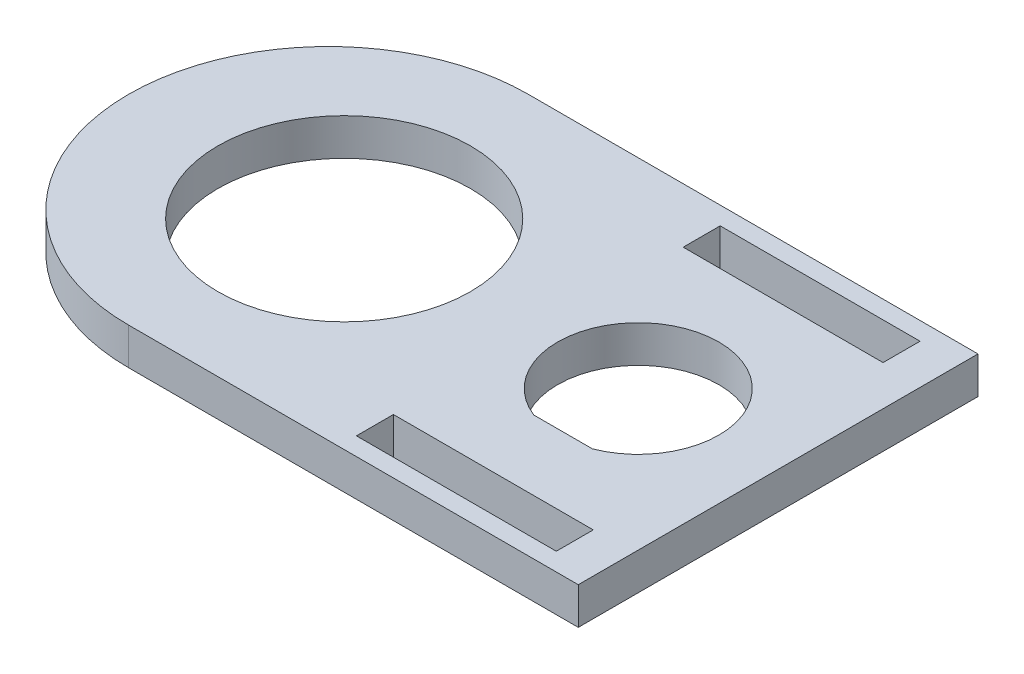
ISO-10303-21;
HEADER;
FILE_DESCRIPTION(('STEP AP214'),'2;1');
FILE_NAME('part.step','',(''),(''),'','','');
FILE_SCHEMA(('AUTOMOTIVE_DESIGN { 1 0 10303 214 1 1 1 1 }'));
ENDSEC;
DATA;
#1=APPLICATION_CONTEXT('core data for automotive mechanical design processes');
#2=APPLICATION_PROTOCOL_DEFINITION('international standard','automotive_design',2000,#1);
#3=PRODUCT_CONTEXT('',#1,'mechanical');
#4=PRODUCT('Part','Part','',(#3));
#5=PRODUCT_RELATED_PRODUCT_CATEGORY('part','',(#4));
#6=PRODUCT_DEFINITION_FORMATION('','',#4);
#7=PRODUCT_DEFINITION_CONTEXT('part definition',#1,'design');
#8=PRODUCT_DEFINITION('design','',#6,#7);
#9=PRODUCT_DEFINITION_SHAPE('','',#8);
#10=(LENGTH_UNIT() NAMED_UNIT(*) SI_UNIT(.MILLI.,.METRE.));
#11=(NAMED_UNIT(*) PLANE_ANGLE_UNIT() SI_UNIT($,.RADIAN.));
#12=(NAMED_UNIT(*) SI_UNIT($,.STERADIAN.) SOLID_ANGLE_UNIT());
#13=UNCERTAINTY_MEASURE_WITH_UNIT(LENGTH_MEASURE(1.E-05),#10,'distance_accuracy_value','');
#14=(GEOMETRIC_REPRESENTATION_CONTEXT(3) GLOBAL_UNCERTAINTY_ASSIGNED_CONTEXT((#13)) GLOBAL_UNIT_ASSIGNED_CONTEXT((#10,
#11,#12)) REPRESENTATION_CONTEXT('',''));
#15=CARTESIAN_POINT('',(0.,0.,0.));
#16=DIRECTION('',(0.,0.,1.));
#17=DIRECTION('',(1.,0.,0.));
#18=AXIS2_PLACEMENT_3D('',#15,#16,#17);
#19=CARTESIAN_POINT('',(0.,2.3495,0.));
#20=DIRECTION('',(0.,1.,0.));
#21=DIRECTION('',(0.,0.,1.));
#22=AXIS2_PLACEMENT_3D('',#19,#20,#21);
#23=PLANE('',#22);
#24=CARTESIAN_POINT('',(23.495,2.3495,0.));
#25=DIRECTION('',(0.,1.,0.));
#26=DIRECTION('',(0.,0.,1.));
#27=AXIS2_PLACEMENT_3D('',#24,#25,#26);
#28=CIRCLE('',#27,10.25);
#29=CARTESIAN_POINT('',(27.2179020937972,2.3495,9.55));
#30=VERTEX_POINT('',#29);
#31=CARTESIAN_POINT('',(19.7720979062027,2.3495,9.55));
#32=VERTEX_POINT('',#31);
#33=EDGE_CURVE('E143',#30,#32,#28,.T.);
#34=ORIENTED_EDGE('',*,*,#33,.F.);
#35=DIRECTION('',(1.,0.,0.));
#36=VECTOR('',#35,1.);
#37=CARTESIAN_POINT('',(19.7720979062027,2.3495,9.55));
#38=LINE('',#37,#36);
#39=EDGE_CURVE('E156',#32,#30,#38,.T.);
#40=ORIENTED_EDGE('',*,*,#39,.F.);
#41=EDGE_LOOP('',(#34,#40));
#42=FACE_BOUND('',#41,.T.);
#43=CARTESIAN_POINT('',(-13.8778317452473,2.3495,0.));
#44=DIRECTION('',(0.,1.,0.));
#45=DIRECTION('',(0.,0.,1.));
#46=AXIS2_PLACEMENT_3D('',#43,#44,#45);
#47=CIRCLE('',#46,16.05);
#48=CARTESIAN_POINT('',(-13.8778317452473,2.3495,16.05));
#49=VERTEX_POINT('',#48);
#50=EDGE_CURVE('E161',#49,#49,#47,.T.);
#51=ORIENTED_EDGE('',*,*,#50,.F.);
#52=EDGE_LOOP('',(#51));
#53=FACE_BOUND('',#52,.T.);
#54=DIRECTION('',(-1.,0.,0.));
#55=VECTOR('',#54,1.);
#56=CARTESIAN_POINT('',(-41.275,2.3495,-25.4));
#57=LINE('',#56,#55);
#58=CARTESIAN_POINT('',(41.275,2.3495,-25.4));
#59=VERTEX_POINT('',#58);
#60=CARTESIAN_POINT('',(-15.875,2.3495,-25.4));
#61=VERTEX_POINT('',#60);
#62=EDGE_CURVE('E235',#59,#61,#57,.T.);
#63=ORIENTED_EDGE('',*,*,#62,.T.);
#64=CARTESIAN_POINT('',(-15.875,2.3495,0.));
#65=DIRECTION('',(0.,1.,0.));
#66=DIRECTION('',(0.,0.,1.));
#67=AXIS2_PLACEMENT_3D('',#64,#65,#66);
#68=CIRCLE('',#67,25.4);
#69=CARTESIAN_POINT('',(-41.275,2.3495,0.));
#70=VERTEX_POINT('',#69);
#71=EDGE_CURVE('E42',#61,#70,#68,.T.);
#72=ORIENTED_EDGE('',*,*,#71,.T.);
#73=CARTESIAN_POINT('',(-15.875,2.3495,0.));
#74=DIRECTION('',(0.,1.,0.));
#75=DIRECTION('',(0.,0.,1.));
#76=AXIS2_PLACEMENT_3D('',#73,#74,#75);
#77=CIRCLE('',#76,25.4);
#78=CARTESIAN_POINT('',(-15.875,2.3495,25.4));
#79=VERTEX_POINT('',#78);
#80=EDGE_CURVE('E49',#70,#79,#77,.T.);
#81=ORIENTED_EDGE('',*,*,#80,.T.);
#82=DIRECTION('',(1.,0.,0.));
#83=VECTOR('',#82,1.);
#84=CARTESIAN_POINT('',(-41.275,2.3495,25.4));
#85=LINE('',#84,#83);
#86=CARTESIAN_POINT('',(41.275,2.3495,25.4));
#87=VERTEX_POINT('',#86);
#88=EDGE_CURVE('E238',#79,#87,#85,.T.);
#89=ORIENTED_EDGE('',*,*,#88,.T.);
#90=DIRECTION('',(0.,0.,-1.));
#91=VECTOR('',#90,1.);
#92=CARTESIAN_POINT('',(41.275,2.3495,-25.4));
#93=LINE('',#92,#91);
#94=EDGE_CURVE('E232',#87,#59,#93,.T.);
#95=ORIENTED_EDGE('',*,*,#94,.T.);
#96=EDGE_LOOP('',(#63,#72,#81,#89,#95));
#97=FACE_BOUND('',#96,.T.);
#98=DIRECTION('',(0.,0.,1.));
#99=VECTOR('',#98,1.);
#100=CARTESIAN_POINT('',(10.795,2.3495,18.415));
#101=LINE('',#100,#99);
#102=CARTESIAN_POINT('',(10.795,2.3495,18.415));
#103=VERTEX_POINT('',#102);
#104=CARTESIAN_POINT('',(10.795,2.3495,23.114));
#105=VERTEX_POINT('',#104);
#106=EDGE_CURVE('E193',#103,#105,#101,.T.);
#107=ORIENTED_EDGE('',*,*,#106,.F.);
#108=DIRECTION('',(-1.,0.,0.));
#109=VECTOR('',#108,1.);
#110=CARTESIAN_POINT('',(36.195,2.3495,18.415));
#111=LINE('',#110,#109);
#112=CARTESIAN_POINT('',(36.195,2.3495,18.415));
#113=VERTEX_POINT('',#112);
#114=EDGE_CURVE('E204',#113,#103,#111,.T.);
#115=ORIENTED_EDGE('',*,*,#114,.F.);
#116=DIRECTION('',(0.,0.,-1.));
#117=VECTOR('',#116,1.);
#118=CARTESIAN_POINT('',(36.195,2.3495,23.114));
#119=LINE('',#118,#117);
#120=CARTESIAN_POINT('',(36.195,2.3495,23.114));
#121=VERTEX_POINT('',#120);
#122=EDGE_CURVE('E218',#121,#113,#119,.T.);
#123=ORIENTED_EDGE('',*,*,#122,.F.);
#124=DIRECTION('',(1.,0.,0.));
#125=VECTOR('',#124,1.);
#126=CARTESIAN_POINT('',(10.795,2.3495,23.114));
#127=LINE('',#126,#125);
#128=EDGE_CURVE('E215',#105,#121,#127,.T.);
#129=ORIENTED_EDGE('',*,*,#128,.F.);
#130=EDGE_LOOP('',(#107,#115,#123,#129));
#131=FACE_BOUND('',#130,.T.);
#132=DIRECTION('',(-1.,0.,0.));
#133=VECTOR('',#132,1.);
#134=CARTESIAN_POINT('',(36.195,2.3495,-18.415));
#135=LINE('',#134,#133);
#136=CARTESIAN_POINT('',(36.195,2.3495,-18.415));
#137=VERTEX_POINT('',#136);
#138=CARTESIAN_POINT('',(10.795,2.3495,-18.415));
#139=VERTEX_POINT('',#138);
#140=EDGE_CURVE('E182',#137,#139,#135,.T.);
#141=ORIENTED_EDGE('',*,*,#140,.T.);
#142=DIRECTION('',(0.,0.,-1.));
#143=VECTOR('',#142,1.);
#144=CARTESIAN_POINT('',(10.795,2.3495,-18.415));
#145=LINE('',#144,#143);
#146=CARTESIAN_POINT('',(10.795,2.3495,-23.114));
#147=VERTEX_POINT('',#146);
#148=EDGE_CURVE('E166',#139,#147,#145,.T.);
#149=ORIENTED_EDGE('',*,*,#148,.T.);
#150=DIRECTION('',(1.,0.,0.));
#151=VECTOR('',#150,1.);
#152=CARTESIAN_POINT('',(10.795,2.3495,-23.114));
#153=LINE('',#152,#151);
#154=CARTESIAN_POINT('',(36.195,2.3495,-23.114));
#155=VERTEX_POINT('',#154);
#156=EDGE_CURVE('E172',#147,#155,#153,.T.);
#157=ORIENTED_EDGE('',*,*,#156,.T.);
#158=DIRECTION('',(0.,0.,1.));
#159=VECTOR('',#158,1.);
#160=CARTESIAN_POINT('',(36.195,2.3495,-23.114));
#161=LINE('',#160,#159);
#162=EDGE_CURVE('E185',#155,#137,#161,.T.);
#163=ORIENTED_EDGE('',*,*,#162,.T.);
#164=EDGE_LOOP('',(#141,#149,#157,#163));
#165=FACE_BOUND('',#164,.T.);
#166=ADVANCED_FACE('F33',(#42,#53,#97,#131,#165),#23,.T.);
#167=CARTESIAN_POINT('',(0.,-2.3495,0.));
#168=DIRECTION('',(0.,1.,0.));
#169=DIRECTION('',(0.,0.,1.));
#170=AXIS2_PLACEMENT_3D('',#167,#168,#169);
#171=PLANE('',#170);
#172=DIRECTION('',(1.,0.,0.));
#173=VECTOR('',#172,1.);
#174=CARTESIAN_POINT('',(19.7720979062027,-2.3495,9.55));
#175=LINE('',#174,#173);
#176=CARTESIAN_POINT('',(19.7720979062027,-2.3495,9.55));
#177=VERTEX_POINT('',#176);
#178=CARTESIAN_POINT('',(27.2179020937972,-2.3495,9.55));
#179=VERTEX_POINT('',#178);
#180=EDGE_CURVE('E148',#177,#179,#175,.T.);
#181=ORIENTED_EDGE('',*,*,#180,.T.);
#182=CARTESIAN_POINT('',(23.495,-2.3495,0.));
#183=DIRECTION('',(0.,1.,0.));
#184=DIRECTION('',(0.,0.,1.));
#185=AXIS2_PLACEMENT_3D('',#182,#183,#184);
#186=CIRCLE('',#185,10.25);
#187=EDGE_CURVE('E140',#179,#177,#186,.T.);
#188=ORIENTED_EDGE('',*,*,#187,.T.);
#189=EDGE_LOOP('',(#181,#188));
#190=FACE_BOUND('',#189,.T.);
#191=CARTESIAN_POINT('',(-13.8778317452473,-2.3495,0.));
#192=DIRECTION('',(0.,1.,0.));
#193=DIRECTION('',(0.,0.,1.));
#194=AXIS2_PLACEMENT_3D('',#191,#192,#193);
#195=CIRCLE('',#194,16.05);
#196=CARTESIAN_POINT('',(-13.8778317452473,-2.3495,16.05));
#197=VERTEX_POINT('',#196);
#198=EDGE_CURVE('E163',#197,#197,#195,.T.);
#199=ORIENTED_EDGE('',*,*,#198,.T.);
#200=EDGE_LOOP('',(#199));
#201=FACE_BOUND('',#200,.T.);
#202=CARTESIAN_POINT('',(-15.875,-2.3495,0.));
#203=DIRECTION('',(0.,1.,0.));
#204=DIRECTION('',(0.,0.,1.));
#205=AXIS2_PLACEMENT_3D('',#202,#203,#204);
#206=CIRCLE('',#205,25.4);
#207=CARTESIAN_POINT('',(-15.875,-2.3495,25.4));
#208=VERTEX_POINT('',#207);
#209=CARTESIAN_POINT('',(-41.275,-2.3495,0.));
#210=VERTEX_POINT('',#209);
#211=EDGE_CURVE('E252',#208,#210,#206,.F.);
#212=ORIENTED_EDGE('',*,*,#211,.T.);
#213=CARTESIAN_POINT('',(-15.875,-2.3495,0.));
#214=DIRECTION('',(0.,1.,0.));
#215=DIRECTION('',(0.,0.,1.));
#216=AXIS2_PLACEMENT_3D('',#213,#214,#215);
#217=CIRCLE('',#216,25.4);
#218=CARTESIAN_POINT('',(-15.875,-2.3495,-25.4));
#219=VERTEX_POINT('',#218);
#220=EDGE_CURVE('E254',#210,#219,#217,.F.);
#221=ORIENTED_EDGE('',*,*,#220,.T.);
#222=DIRECTION('',(-1.,0.,0.));
#223=VECTOR('',#222,1.);
#224=CARTESIAN_POINT('',(-41.275,-2.3495,-25.4));
#225=LINE('',#224,#223);
#226=CARTESIAN_POINT('',(41.275,-2.3495,-25.4));
#227=VERTEX_POINT('',#226);
#228=EDGE_CURVE('E243',#227,#219,#225,.T.);
#229=ORIENTED_EDGE('',*,*,#228,.F.);
#230=DIRECTION('',(0.,0.,-1.));
#231=VECTOR('',#230,1.);
#232=CARTESIAN_POINT('',(41.275,-2.3495,-25.4));
#233=LINE('',#232,#231);
#234=CARTESIAN_POINT('',(41.275,-2.3495,25.4));
#235=VERTEX_POINT('',#234);
#236=EDGE_CURVE('E225',#235,#227,#233,.T.);
#237=ORIENTED_EDGE('',*,*,#236,.F.);
#238=DIRECTION('',(1.,0.,0.));
#239=VECTOR('',#238,1.);
#240=CARTESIAN_POINT('',(-41.275,-2.3495,25.4));
#241=LINE('',#240,#239);
#242=EDGE_CURVE('E236',#208,#235,#241,.T.);
#243=ORIENTED_EDGE('',*,*,#242,.F.);
#244=EDGE_LOOP('',(#212,#221,#229,#237,#243));
#245=FACE_BOUND('',#244,.T.);
#246=DIRECTION('',(-1.,0.,0.));
#247=VECTOR('',#246,1.);
#248=CARTESIAN_POINT('',(36.195,-2.3495,18.415));
#249=LINE('',#248,#247);
#250=CARTESIAN_POINT('',(36.195,-2.3495,18.415));
#251=VERTEX_POINT('',#250);
#252=CARTESIAN_POINT('',(10.795,-2.3495,18.415));
#253=VERTEX_POINT('',#252);
#254=EDGE_CURVE('E210',#251,#253,#249,.T.);
#255=ORIENTED_EDGE('',*,*,#254,.T.);
#256=DIRECTION('',(0.,0.,1.));
#257=VECTOR('',#256,1.);
#258=CARTESIAN_POINT('',(10.795,-2.3495,18.415));
#259=LINE('',#258,#257);
#260=CARTESIAN_POINT('',(10.795,-2.3495,23.114));
#261=VERTEX_POINT('',#260);
#262=EDGE_CURVE('E200',#253,#261,#259,.T.);
#263=ORIENTED_EDGE('',*,*,#262,.T.);
#264=DIRECTION('',(1.,0.,0.));
#265=VECTOR('',#264,1.);
#266=CARTESIAN_POINT('',(10.795,-2.3495,23.114));
#267=LINE('',#266,#265);
#268=CARTESIAN_POINT('',(36.195,-2.3495,23.114));
#269=VERTEX_POINT('',#268);
#270=EDGE_CURVE('E203',#261,#269,#267,.T.);
#271=ORIENTED_EDGE('',*,*,#270,.T.);
#272=DIRECTION('',(0.,0.,-1.));
#273=VECTOR('',#272,1.);
#274=CARTESIAN_POINT('',(36.195,-2.3495,23.114));
#275=LINE('',#274,#273);
#276=EDGE_CURVE('E207',#269,#251,#275,.T.);
#277=ORIENTED_EDGE('',*,*,#276,.T.);
#278=EDGE_LOOP('',(#255,#263,#271,#277));
#279=FACE_BOUND('',#278,.T.);
#280=DIRECTION('',(0.,0.,-1.));
#281=VECTOR('',#280,1.);
#282=CARTESIAN_POINT('',(10.795,-2.3495,-18.415));
#283=LINE('',#282,#281);
#284=CARTESIAN_POINT('',(10.795,-2.3495,-18.415));
#285=VERTEX_POINT('',#284);
#286=CARTESIAN_POINT('',(10.795,-2.3495,-23.114));
#287=VERTEX_POINT('',#286);
#288=EDGE_CURVE('E169',#285,#287,#283,.T.);
#289=ORIENTED_EDGE('',*,*,#288,.F.);
#290=DIRECTION('',(-1.,0.,0.));
#291=VECTOR('',#290,1.);
#292=CARTESIAN_POINT('',(36.195,-2.3495,-18.415));
#293=LINE('',#292,#291);
#294=CARTESIAN_POINT('',(36.195,-2.3495,-18.415));
#295=VERTEX_POINT('',#294);
#296=EDGE_CURVE('E171',#295,#285,#293,.T.);
#297=ORIENTED_EDGE('',*,*,#296,.F.);
#298=DIRECTION('',(0.,0.,1.));
#299=VECTOR('',#298,1.);
#300=CARTESIAN_POINT('',(36.195,-2.3495,-23.114));
#301=LINE('',#300,#299);
#302=CARTESIAN_POINT('',(36.195,-2.3495,-23.114));
#303=VERTEX_POINT('',#302);
#304=EDGE_CURVE('E174',#303,#295,#301,.T.);
#305=ORIENTED_EDGE('',*,*,#304,.F.);
#306=DIRECTION('',(1.,0.,0.));
#307=VECTOR('',#306,1.);
#308=CARTESIAN_POINT('',(10.795,-2.3495,-23.114));
#309=LINE('',#308,#307);
#310=EDGE_CURVE('E177',#287,#303,#309,.T.);
#311=ORIENTED_EDGE('',*,*,#310,.F.);
#312=EDGE_LOOP('',(#289,#297,#305,#311));
#313=FACE_BOUND('',#312,.T.);
#314=ADVANCED_FACE('F154',(#190,#201,#245,#279,#313),#171,.F.);
#315=CARTESIAN_POINT('',(41.275,2.3495,-25.4));
#316=DIRECTION('',(-1.,0.,0.));
#317=DIRECTION('',(0.,0.,1.));
#318=AXIS2_PLACEMENT_3D('',#315,#316,#317);
#319=PLANE('',#318);
#320=ORIENTED_EDGE('',*,*,#236,.T.);
#321=DIRECTION('',(0.,-1.,0.));
#322=VECTOR('',#321,1.);
#323=CARTESIAN_POINT('',(41.275,2.3495,-25.4));
#324=LINE('',#323,#322);
#325=EDGE_CURVE('E249',#59,#227,#324,.T.);
#326=ORIENTED_EDGE('',*,*,#325,.F.);
#327=ORIENTED_EDGE('',*,*,#94,.F.);
#328=DIRECTION('',(0.,-1.,0.));
#329=VECTOR('',#328,1.);
#330=CARTESIAN_POINT('',(41.275,2.3495,25.4));
#331=LINE('',#330,#329);
#332=EDGE_CURVE('E240',#87,#235,#331,.T.);
#333=ORIENTED_EDGE('',*,*,#332,.T.);
#334=EDGE_LOOP('',(#320,#326,#327,#333));
#335=FACE_BOUND('',#334,.T.);
#336=ADVANCED_FACE('F270',(#335),#319,.F.);
#337=CARTESIAN_POINT('',(-41.275,2.3495,-25.4));
#338=DIRECTION('',(0.,0.,1.));
#339=DIRECTION('',(1.,0.,0.));
#340=AXIS2_PLACEMENT_3D('',#337,#338,#339);
#341=PLANE('',#340);
#342=ORIENTED_EDGE('',*,*,#228,.T.);
#343=DIRECTION('',(0.,-1.,0.));
#344=VECTOR('',#343,1.);
#345=CARTESIAN_POINT('',(-15.875,2.3495,-25.4));
#346=LINE('',#345,#344);
#347=EDGE_CURVE('E256',#219,#61,#346,.F.);
#348=ORIENTED_EDGE('',*,*,#347,.T.);
#349=ORIENTED_EDGE('',*,*,#62,.F.);
#350=ORIENTED_EDGE('',*,*,#325,.T.);
#351=EDGE_LOOP('',(#342,#348,#349,#350));
#352=FACE_BOUND('',#351,.T.);
#353=ADVANCED_FACE('F262',(#352),#341,.F.);
#354=CARTESIAN_POINT('',(-41.275,2.3495,25.4));
#355=DIRECTION('',(0.,0.,-1.));
#356=DIRECTION('',(-1.,0.,0.));
#357=AXIS2_PLACEMENT_3D('',#354,#355,#356);
#358=PLANE('',#357);
#359=ORIENTED_EDGE('',*,*,#88,.F.);
#360=DIRECTION('',(0.,-1.,0.));
#361=VECTOR('',#360,1.);
#362=CARTESIAN_POINT('',(-15.875,2.3495,25.4));
#363=LINE('',#362,#361);
#364=EDGE_CURVE('E11',#79,#208,#363,.T.);
#365=ORIENTED_EDGE('',*,*,#364,.T.);
#366=ORIENTED_EDGE('',*,*,#242,.T.);
#367=ORIENTED_EDGE('',*,*,#332,.F.);
#368=EDGE_LOOP('',(#359,#365,#366,#367));
#369=FACE_BOUND('',#368,.T.);
#370=ADVANCED_FACE('F282',(#369),#358,.F.);
#371=CARTESIAN_POINT('',(10.795,-2.3495,18.415));
#372=DIRECTION('',(-1.,0.,0.));
#373=DIRECTION('',(0.,0.,1.));
#374=AXIS2_PLACEMENT_3D('',#371,#372,#373);
#375=PLANE('',#374);
#376=ORIENTED_EDGE('',*,*,#106,.T.);
#377=DIRECTION('',(0.,1.,0.));
#378=VECTOR('',#377,1.);
#379=CARTESIAN_POINT('',(10.795,-2.3495,23.114));
#380=LINE('',#379,#378);
#381=EDGE_CURVE('E213',#261,#105,#380,.T.);
#382=ORIENTED_EDGE('',*,*,#381,.F.);
#383=ORIENTED_EDGE('',*,*,#262,.F.);
#384=DIRECTION('',(0.,1.,0.));
#385=VECTOR('',#384,1.);
#386=CARTESIAN_POINT('',(10.795,-2.3495,18.415));
#387=LINE('',#386,#385);
#388=EDGE_CURVE('E223',#253,#103,#387,.T.);
#389=ORIENTED_EDGE('',*,*,#388,.T.);
#390=EDGE_LOOP('',(#376,#382,#383,#389));
#391=FACE_BOUND('',#390,.T.);
#392=ADVANCED_FACE('F284',(#391),#375,.F.);
#393=CARTESIAN_POINT('',(36.195,-2.3495,18.415));
#394=DIRECTION('',(0.,0.,-1.));
#395=DIRECTION('',(-1.,0.,0.));
#396=AXIS2_PLACEMENT_3D('',#393,#394,#395);
#397=PLANE('',#396);
#398=ORIENTED_EDGE('',*,*,#114,.T.);
#399=ORIENTED_EDGE('',*,*,#388,.F.);
#400=ORIENTED_EDGE('',*,*,#254,.F.);
#401=DIRECTION('',(0.,1.,0.));
#402=VECTOR('',#401,1.);
#403=CARTESIAN_POINT('',(36.195,-2.3495,18.415));
#404=LINE('',#403,#402);
#405=EDGE_CURVE('E226',#251,#113,#404,.T.);
#406=ORIENTED_EDGE('',*,*,#405,.T.);
#407=EDGE_LOOP('',(#398,#399,#400,#406));
#408=FACE_BOUND('',#407,.T.);
#409=ADVANCED_FACE('F290',(#408),#397,.F.);
#410=CARTESIAN_POINT('',(36.195,-2.3495,23.114));
#411=DIRECTION('',(1.,0.,0.));
#412=DIRECTION('',(0.,0.,-1.));
#413=AXIS2_PLACEMENT_3D('',#410,#411,#412);
#414=PLANE('',#413);
#415=ORIENTED_EDGE('',*,*,#122,.T.);
#416=ORIENTED_EDGE('',*,*,#405,.F.);
#417=ORIENTED_EDGE('',*,*,#276,.F.);
#418=DIRECTION('',(0.,1.,0.));
#419=VECTOR('',#418,1.);
#420=CARTESIAN_POINT('',(36.195,-2.3495,23.114));
#421=LINE('',#420,#419);
#422=EDGE_CURVE('E228',#269,#121,#421,.T.);
#423=ORIENTED_EDGE('',*,*,#422,.T.);
#424=EDGE_LOOP('',(#415,#416,#417,#423));
#425=FACE_BOUND('',#424,.T.);
#426=ADVANCED_FACE('F307',(#425),#414,.F.);
#427=CARTESIAN_POINT('',(10.795,-2.3495,23.114));
#428=DIRECTION('',(0.,0.,1.));
#429=DIRECTION('',(1.,0.,0.));
#430=AXIS2_PLACEMENT_3D('',#427,#428,#429);
#431=PLANE('',#430);
#432=ORIENTED_EDGE('',*,*,#128,.T.);
#433=ORIENTED_EDGE('',*,*,#422,.F.);
#434=ORIENTED_EDGE('',*,*,#270,.F.);
#435=ORIENTED_EDGE('',*,*,#381,.T.);
#436=EDGE_LOOP('',(#432,#433,#434,#435));
#437=FACE_BOUND('',#436,.T.);
#438=ADVANCED_FACE('F303',(#437),#431,.F.);
#439=CARTESIAN_POINT('',(10.795,-2.3495,-18.415));
#440=DIRECTION('',(1.,0.,0.));
#441=DIRECTION('',(0.,0.,-1.));
#442=AXIS2_PLACEMENT_3D('',#439,#440,#441);
#443=PLANE('',#442);
#444=ORIENTED_EDGE('',*,*,#148,.F.);
#445=DIRECTION('',(0.,1.,0.));
#446=VECTOR('',#445,1.);
#447=CARTESIAN_POINT('',(10.795,-2.3495,-18.415));
#448=LINE('',#447,#446);
#449=EDGE_CURVE('E179',#285,#139,#448,.T.);
#450=ORIENTED_EDGE('',*,*,#449,.F.);
#451=ORIENTED_EDGE('',*,*,#288,.T.);
#452=DIRECTION('',(0.,1.,0.));
#453=VECTOR('',#452,1.);
#454=CARTESIAN_POINT('',(10.795,-2.3495,-23.114));
#455=LINE('',#454,#453);
#456=EDGE_CURVE('E190',#287,#147,#455,.T.);
#457=ORIENTED_EDGE('',*,*,#456,.T.);
#458=EDGE_LOOP('',(#444,#450,#451,#457));
#459=FACE_BOUND('',#458,.T.);
#460=ADVANCED_FACE('F306',(#459),#443,.T.);
#461=CARTESIAN_POINT('',(10.795,-2.3495,-23.114));
#462=DIRECTION('',(0.,0.,1.));
#463=DIRECTION('',(1.,0.,0.));
#464=AXIS2_PLACEMENT_3D('',#461,#462,#463);
#465=PLANE('',#464);
#466=ORIENTED_EDGE('',*,*,#156,.F.);
#467=ORIENTED_EDGE('',*,*,#456,.F.);
#468=ORIENTED_EDGE('',*,*,#310,.T.);
#469=DIRECTION('',(0.,1.,0.));
#470=VECTOR('',#469,1.);
#471=CARTESIAN_POINT('',(36.195,-2.3495,-23.114));
#472=LINE('',#471,#470);
#473=EDGE_CURVE('E194',#303,#155,#472,.T.);
#474=ORIENTED_EDGE('',*,*,#473,.T.);
#475=EDGE_LOOP('',(#466,#467,#468,#474));
#476=FACE_BOUND('',#475,.T.);
#477=ADVANCED_FACE('F317',(#476),#465,.T.);
#478=CARTESIAN_POINT('',(36.195,-2.3495,-23.114));
#479=DIRECTION('',(-1.,0.,0.));
#480=DIRECTION('',(0.,0.,1.));
#481=AXIS2_PLACEMENT_3D('',#478,#479,#480);
#482=PLANE('',#481);
#483=ORIENTED_EDGE('',*,*,#162,.F.);
#484=ORIENTED_EDGE('',*,*,#473,.F.);
#485=ORIENTED_EDGE('',*,*,#304,.T.);
#486=DIRECTION('',(0.,1.,0.));
#487=VECTOR('',#486,1.);
#488=CARTESIAN_POINT('',(36.195,-2.3495,-18.415));
#489=LINE('',#488,#487);
#490=EDGE_CURVE('E196',#295,#137,#489,.T.);
#491=ORIENTED_EDGE('',*,*,#490,.T.);
#492=EDGE_LOOP('',(#483,#484,#485,#491));
#493=FACE_BOUND('',#492,.T.);
#494=ADVANCED_FACE('F323',(#493),#482,.T.);
#495=CARTESIAN_POINT('',(36.195,-2.3495,-18.415));
#496=DIRECTION('',(0.,0.,-1.));
#497=DIRECTION('',(-1.,0.,0.));
#498=AXIS2_PLACEMENT_3D('',#495,#496,#497);
#499=PLANE('',#498);
#500=ORIENTED_EDGE('',*,*,#140,.F.);
#501=ORIENTED_EDGE('',*,*,#490,.F.);
#502=ORIENTED_EDGE('',*,*,#296,.T.);
#503=ORIENTED_EDGE('',*,*,#449,.T.);
#504=EDGE_LOOP('',(#500,#501,#502,#503));
#505=FACE_BOUND('',#504,.T.);
#506=ADVANCED_FACE('F319',(#505),#499,.T.);
#507=CARTESIAN_POINT('',(-13.8778317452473,-2.3495,0.));
#508=DIRECTION('',(0.,1.,0.));
#509=DIRECTION('',(0.,0.,1.));
#510=AXIS2_PLACEMENT_3D('',#507,#508,#509);
#511=CYLINDRICAL_SURFACE('',#510,16.05);
#512=ORIENTED_EDGE('',*,*,#198,.F.);
#513=EDGE_LOOP('',(#512));
#514=FACE_BOUND('',#513,.T.);
#515=ORIENTED_EDGE('',*,*,#50,.T.);
#516=EDGE_LOOP('',(#515));
#517=FACE_BOUND('',#516,.T.);
#518=ADVANCED_FACE('F322',(#514,#517),#511,.F.);
#519=CARTESIAN_POINT('',(23.495,-2.3495,0.));
#520=DIRECTION('',(0.,1.,0.));
#521=DIRECTION('',(0.,0.,1.));
#522=AXIS2_PLACEMENT_3D('',#519,#520,#521);
#523=CYLINDRICAL_SURFACE('',#522,10.25);
#524=ORIENTED_EDGE('',*,*,#33,.T.);
#525=DIRECTION('',(0.,1.,0.));
#526=VECTOR('',#525,1.);
#527=CARTESIAN_POINT('',(19.7720979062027,-2.3495,9.55));
#528=LINE('',#527,#526);
#529=EDGE_CURVE('E136',#177,#32,#528,.T.);
#530=ORIENTED_EDGE('',*,*,#529,.F.);
#531=ORIENTED_EDGE('',*,*,#187,.F.);
#532=DIRECTION('',(0.,1.,0.));
#533=VECTOR('',#532,1.);
#534=CARTESIAN_POINT('',(27.2179020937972,-2.3495,9.55));
#535=LINE('',#534,#533);
#536=EDGE_CURVE('E147',#179,#30,#535,.T.);
#537=ORIENTED_EDGE('',*,*,#536,.T.);
#538=EDGE_LOOP('',(#524,#530,#531,#537));
#539=FACE_BOUND('',#538,.T.);
#540=ADVANCED_FACE('F138',(#539),#523,.F.);
#541=CARTESIAN_POINT('',(19.7720979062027,-2.3495,9.55));
#542=DIRECTION('',(0.,0.,1.));
#543=DIRECTION('',(1.,0.,0.));
#544=AXIS2_PLACEMENT_3D('',#541,#542,#543);
#545=PLANE('',#544);
#546=ORIENTED_EDGE('',*,*,#39,.T.);
#547=ORIENTED_EDGE('',*,*,#536,.F.);
#548=ORIENTED_EDGE('',*,*,#180,.F.);
#549=ORIENTED_EDGE('',*,*,#529,.T.);
#550=EDGE_LOOP('',(#546,#547,#548,#549));
#551=FACE_BOUND('',#550,.T.);
#552=ADVANCED_FACE('F151',(#551),#545,.F.);
#553=CARTESIAN_POINT('',(-15.875,2.3495,0.));
#554=DIRECTION('',(0.,-1.,0.));
#555=DIRECTION('',(0.,0.,-1.));
#556=AXIS2_PLACEMENT_3D('',#553,#554,#555);
#557=CYLINDRICAL_SURFACE('',#556,25.4);
#558=ORIENTED_EDGE('',*,*,#364,.F.);
#559=ORIENTED_EDGE('',*,*,#80,.F.);
#560=DIRECTION('',(0.,-1.,0.));
#561=VECTOR('',#560,1.);
#562=CARTESIAN_POINT('',(-41.275,2.3495,0.));
#563=LINE('',#562,#561);
#564=EDGE_CURVE('E37',#210,#70,#563,.F.);
#565=ORIENTED_EDGE('',*,*,#564,.F.);
#566=ORIENTED_EDGE('',*,*,#211,.F.);
#567=EDGE_LOOP('',(#558,#559,#565,#566));
#568=FACE_BOUND('',#567,.T.);
#569=ADVANCED_FACE('F35',(#568),#557,.T.);
#570=CARTESIAN_POINT('',(-15.875,2.3495,0.));
#571=DIRECTION('',(0.,-1.,0.));
#572=DIRECTION('',(0.,0.,-1.));
#573=AXIS2_PLACEMENT_3D('',#570,#571,#572);
#574=CYLINDRICAL_SURFACE('',#573,25.4);
#575=ORIENTED_EDGE('',*,*,#71,.F.);
#576=ORIENTED_EDGE('',*,*,#347,.F.);
#577=ORIENTED_EDGE('',*,*,#220,.F.);
#578=ORIENTED_EDGE('',*,*,#564,.T.);
#579=EDGE_LOOP('',(#575,#576,#577,#578));
#580=FACE_BOUND('',#579,.T.);
#581=ADVANCED_FACE('F278',(#580),#574,.T.);
#582=CLOSED_SHELL('',(#166,#314,#336,#353,#370,#392,#409,#426,#438,#460,#477,#494,#506,#518,
#540,#552,#569,#581));
#583=MANIFOLD_SOLID_BREP('B2',#582);
#584=ADVANCED_BREP_SHAPE_REPRESENTATION('',(#18,#583),#14);
#585=SHAPE_DEFINITION_REPRESENTATION(#9,#584);
ENDSEC;
END-ISO-10303-21;
